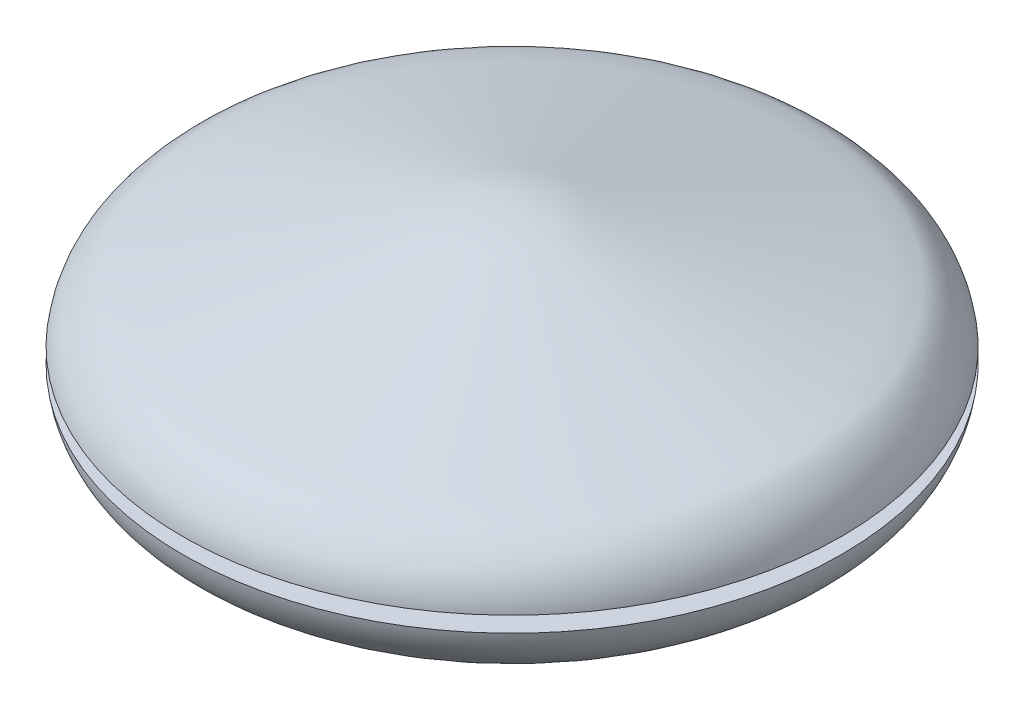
ISO-10303-21;
HEADER;
FILE_DESCRIPTION(('STEP AP214'),'2;1');
FILE_NAME('part.step','',(''),(''),'','','');
FILE_SCHEMA(('AUTOMOTIVE_DESIGN { 1 0 10303 214 1 1 1 1 }'));
ENDSEC;
DATA;
#1=APPLICATION_CONTEXT('core data for automotive mechanical design processes');
#2=APPLICATION_PROTOCOL_DEFINITION('international standard','automotive_design',2000,#1);
#3=PRODUCT_CONTEXT('',#1,'mechanical');
#4=PRODUCT('Part','Part','',(#3));
#5=PRODUCT_RELATED_PRODUCT_CATEGORY('part','',(#4));
#6=PRODUCT_DEFINITION_FORMATION('','',#4);
#7=PRODUCT_DEFINITION_CONTEXT('part definition',#1,'design');
#8=PRODUCT_DEFINITION('design','',#6,#7);
#9=PRODUCT_DEFINITION_SHAPE('','',#8);
#10=(LENGTH_UNIT() NAMED_UNIT(*) SI_UNIT(.MILLI.,.METRE.));
#11=(NAMED_UNIT(*) PLANE_ANGLE_UNIT() SI_UNIT($,.RADIAN.));
#12=(NAMED_UNIT(*) SI_UNIT($,.STERADIAN.) SOLID_ANGLE_UNIT());
#13=UNCERTAINTY_MEASURE_WITH_UNIT(LENGTH_MEASURE(1.E-05),#10,'distance_accuracy_value','');
#14=(GEOMETRIC_REPRESENTATION_CONTEXT(3) GLOBAL_UNCERTAINTY_ASSIGNED_CONTEXT((#13)) GLOBAL_UNIT_ASSIGNED_CONTEXT((#10,
#11,#12)) REPRESENTATION_CONTEXT('',''));
#15=CARTESIAN_POINT('',(0.,0.,0.));
#16=DIRECTION('',(0.,0.,1.));
#17=DIRECTION('',(1.,0.,0.));
#18=AXIS2_PLACEMENT_3D('',#15,#16,#17);
#19=CARTESIAN_POINT('',(0.,-19.5,0.));
#20=CARTESIAN_POINT('',(1.58855300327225,-19.5,0.));
#21=CARTESIAN_POINT('',(3.17483133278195,-19.4150193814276,0.));
#22=CARTESIAN_POINT('',(4.75429215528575,-19.2453015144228,0.));
#23=CARTESIAN_POINT('',(4.9296947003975,-19.2264539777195,0.));
#24=CARTESIAN_POINT('',(5.2802756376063,-19.1866728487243,0.));
#25=CARTESIAN_POINT('',(5.80578212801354,-19.1228170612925,0.));
#26=CARTESIAN_POINT('',(6.15501922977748,-19.072631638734,0.));
#27=CARTESIAN_POINT('',(6.32963778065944,-19.0475389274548,0.));
#28=CARTESIAN_POINT('',(6.5042563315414,-19.0224462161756,0.));
#29=CARTESIAN_POINT('',(6.85349343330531,-18.9722607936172,0.));
#30=CARTESIAN_POINT('',(7.37734908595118,-18.8969826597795,0.));
#31=CARTESIAN_POINT('',(7.72658618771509,-18.8467972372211,0.));
#32=CARTESIAN_POINT('',(7.90120473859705,-18.8217045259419,0.));
#33=CARTESIAN_POINT('',(18.989436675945,-17.2283239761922,0.));
#34=CARTESIAN_POINT('',(30.0776686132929,-15.6349434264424,0.));
#35=CARTESIAN_POINT('',(41.1659005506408,-14.0415628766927,0.));
#36=CARTESIAN_POINT('',(42.4561325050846,-13.8561563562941,0.));
#37=CARTESIAN_POINT('',(45.0365964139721,-13.4853433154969,0.));
#38=CARTESIAN_POINT('',(48.9072922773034,-12.9291237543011,0.));
#39=CARTESIAN_POINT('',(51.4877561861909,-12.5583107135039,0.));
#40=CARTESIAN_POINT('',(52.7779881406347,-12.3729041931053,0.));
#41=CARTESIAN_POINT('',(53.7007098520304,-12.240308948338,0.));
#42=CARTESIAN_POINT('',(55.5461532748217,-11.9751184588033,0.));
#43=CARTESIAN_POINT('',(58.1537486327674,-10.3790350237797,0.));
#44=CARTESIAN_POINT('',(59.5693539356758,-9.14795988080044,0.));
#45=CARTESIAN_POINT('',(60.2004034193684,-8.46183058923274,0.));
#46=CARTESIAN_POINT('',(64.3973475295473,-3.89856516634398,0.));
#47=CARTESIAN_POINT('',(64.7637835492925,2.29041341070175,0.));
#48=CARTESIAN_POINT('',(61.134636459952,7.31704474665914,0.));
#49=CARTESIAN_POINT('',(60.5889605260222,8.0728454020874,0.));
#50=CARTESIAN_POINT('',(59.3285148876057,9.46236372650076,0.));
#51=CARTESIAN_POINT('',(56.9274789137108,11.3549973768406,0.));
#52=CARTESIAN_POINT('',(55.1262219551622,11.836101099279,0.));
#53=CARTESIAN_POINT('',(54.225593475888,12.0766529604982,0.));
#54=CARTESIAN_POINT('',(53.0383023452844,12.3937705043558,0.));
#55=CARTESIAN_POINT('',(50.6637200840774,13.0280055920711,0.));
#56=CARTESIAN_POINT('',(47.1018466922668,13.9793582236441,0.));
#57=CARTESIAN_POINT('',(44.7272644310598,14.6135933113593,0.));
#58=CARTESIAN_POINT('',(43.5399733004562,14.930710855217,0.));
#59=CARTESIAN_POINT('',(33.7892849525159,17.5350546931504,0.));
#60=CARTESIAN_POINT('',(24.0385966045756,20.1393985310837,0.));
#61=CARTESIAN_POINT('',(14.2879082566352,22.7437423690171,0.));
#62=CARTESIAN_POINT('',(13.9762643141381,22.8269803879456,0.));
#63=CARTESIAN_POINT('',(13.3529764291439,22.9934564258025,0.));
#64=CARTESIAN_POINT('',(12.4180446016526,23.243170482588,0.));
#65=CARTESIAN_POINT('',(11.7947567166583,23.409646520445,0.));
#66=CARTESIAN_POINT('',(11.4831127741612,23.4928845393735,0.));
#67=CARTESIAN_POINT('',(11.1714688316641,23.5761225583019,0.));
#68=CARTESIAN_POINT('',(10.5481809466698,23.7425985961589,0.));
#69=CARTESIAN_POINT('',(9.60323358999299,23.9550354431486,0.));
#70=CARTESIAN_POINT('',(8.97178156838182,24.0873971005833,0.));
#71=CARTESIAN_POINT('',(8.65537337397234,24.1501375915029,0.));
#72=CARTESIAN_POINT('',(5.80263754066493,24.7158057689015,0.));
#73=CARTESIAN_POINT('',(2.90827822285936,25.,0.));
#74=CARTESIAN_POINT('',(0.,25.,0.));
#75=(BOUNDED_CURVE() B_SPLINE_CURVE(3,(#19,#20,#21,#22,#23,#24,#25,#26,#27,#28,#29,#30,#31,#32,
#33,#34,#35,#36,#37,#38,#39,#40,#41,#42,#43,#44,#45,#46,#47,#48,#49,#50,#51,#52,#53,#54,#55,#56,
#57,#58,#59,#60,#61,#62,#63,#64,#65,#66,#67,#68,#69,#70,#71,#72,#73,#74),.UNSPECIFIED.,.F.,
.F.) B_SPLINE_CURVE_WITH_KNOTS((4,3,1,1,3,1,1,3,3,1,1,3,1,1,3,3,1,1,3,1,1,3,3,1,1,3,1,1,3,4),
(0.,0.0335996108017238,0.0373344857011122,0.0410693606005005,0.0448042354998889,
0.0485391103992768,0.0522739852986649,0.056008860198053,0.293172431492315,0.320768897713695,
0.348365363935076,0.375961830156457,0.395697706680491,0.415433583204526,0.43516945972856,
0.546717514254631,0.566453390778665,0.5861892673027,0.605925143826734,0.631942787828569,
0.657960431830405,0.68397807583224,0.897649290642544,0.904478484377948,0.911307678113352,
0.918136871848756,0.92496606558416,0.931795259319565,0.938624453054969,1.),
.UNSPECIFIED.) CURVE() GEOMETRIC_REPRESENTATION_ITEM() RATIONAL_B_SPLINE_CURVE((1.,
0.999045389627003,0.999045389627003,1.,1.,1.,1.,1.,1.,1.,1.,1.,1.,1.,1.,1.,1.,1.,1.,1.,1.,1.,1.,
1.,1.,1.,1.,0.849837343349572,0.849837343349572,1.,1.,1.,1.,1.,1.,1.,1.,1.,1.,1.,1.,1.,1.,1.,1.,
1.,1.,1.,1.,1.,1.,1.,1.,0.996809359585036,0.996809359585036,1.)) REPRESENTATION_ITEM(''));
#76=CARTESIAN_POINT('',(0.,-19.5,0.));
#77=DIRECTION('',(0.,-1.,0.));
#78=AXIS1_PLACEMENT('',#76,#77);
#79=SURFACE_OF_REVOLUTION('',#75,#78);
#80=CARTESIAN_POINT('',(0.,-19.5,0.));
#81=VERTEX_POINT('',#80);
#82=VERTEX_LOOP('',#81);
#83=FACE_BOUND('',#82,.T.);
#84=CARTESIAN_POINT('',(0.,-1.50000000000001,0.));
#85=DIRECTION('',(0.,-1.,0.));
#86=DIRECTION('',(1.,0.,0.));
#87=AXIS2_PLACEMENT_3D('',#84,#85,#86);
#88=CIRCLE('',#87,63.4096736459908);
#89=CARTESIAN_POINT('',(63.4096736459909,-1.49999999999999,0.));
#90=VERTEX_POINT('',#89);
#91=EDGE_CURVE('E12',#90,#90,#88,.T.);
#92=ORIENTED_EDGE('',*,*,#91,.T.);
#93=EDGE_LOOP('',(#92));
#94=FACE_BOUND('',#93,.T.);
#95=ADVANCED_FACE('F38',(#83,#94),#79,.F.);
#96=CARTESIAN_POINT('',(0.,-1.5,0.));
#97=DIRECTION('',(0.,1.,0.));
#98=DIRECTION('',(0.,0.,1.));
#99=AXIS2_PLACEMENT_3D('',#96,#97,#98);
#100=PLANE('',#99);
#101=ORIENTED_EDGE('',*,*,#91,.F.);
#102=EDGE_LOOP('',(#101));
#103=FACE_BOUND('',#102,.T.);
#104=CARTESIAN_POINT('',(0.,-1.5,0.));
#105=DIRECTION('',(0.,1.,0.));
#106=DIRECTION('',(1.,0.,0.));
#107=AXIS2_PLACEMENT_3D('',#104,#105,#106);
#108=CIRCLE('',#107,57.1499999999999);
#109=CARTESIAN_POINT('',(57.15,-1.5,0.));
#110=VERTEX_POINT('',#109);
#111=EDGE_CURVE('E75',#110,#110,#108,.T.);
#112=ORIENTED_EDGE('',*,*,#111,.F.);
#113=EDGE_LOOP('',(#112));
#114=FACE_BOUND('',#113,.T.);
#115=ADVANCED_FACE('F64',(#103,#114),#100,.T.);
#116=CARTESIAN_POINT('',(0.,1.5,0.));
#117=DIRECTION('',(0.,1.,0.));
#118=DIRECTION('',(0.,0.,1.));
#119=AXIS2_PLACEMENT_3D('',#116,#117,#118);
#120=PLANE('',#119);
#121=CARTESIAN_POINT('',(0.,1.49999999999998,0.));
#122=DIRECTION('',(0.,-1.,0.));
#123=DIRECTION('',(1.,0.,0.));
#124=AXIS2_PLACEMENT_3D('',#121,#122,#123);
#125=CIRCLE('',#124,63.4096736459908);
#126=CARTESIAN_POINT('',(63.4096736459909,1.5,0.));
#127=VERTEX_POINT('',#126);
#128=EDGE_CURVE('E47',#127,#127,#125,.T.);
#129=ORIENTED_EDGE('',*,*,#128,.T.);
#130=EDGE_LOOP('',(#129));
#131=FACE_BOUND('',#130,.T.);
#132=CARTESIAN_POINT('',(0.,1.5,0.));
#133=DIRECTION('',(0.,1.,0.));
#134=DIRECTION('',(1.,0.,0.));
#135=AXIS2_PLACEMENT_3D('',#132,#133,#134);
#136=CIRCLE('',#135,57.1499999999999);
#137=CARTESIAN_POINT('',(57.15,1.5,0.));
#138=VERTEX_POINT('',#137);
#139=EDGE_CURVE('E76',#138,#138,#136,.T.);
#140=ORIENTED_EDGE('',*,*,#139,.T.);
#141=EDGE_LOOP('',(#140));
#142=FACE_BOUND('',#141,.T.);
#143=ADVANCED_FACE('F59',(#131,#142),#120,.F.);
#144=CARTESIAN_POINT('',(0.,-1.5,0.));
#145=DIRECTION('',(0.,1.,0.));
#146=DIRECTION('',(0.,0.,1.));
#147=AXIS2_PLACEMENT_3D('',#144,#145,#146);
#148=CYLINDRICAL_SURFACE('',#147,57.1499999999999);
#149=ORIENTED_EDGE('',*,*,#111,.T.);
#150=EDGE_LOOP('',(#149));
#151=FACE_BOUND('',#150,.T.);
#152=ORIENTED_EDGE('',*,*,#139,.F.);
#153=EDGE_LOOP('',(#152));
#154=FACE_BOUND('',#153,.T.);
#155=ADVANCED_FACE('F54',(#151,#154),#148,.T.);
#156=ORIENTED_EDGE('',*,*,#128,.F.);
#157=EDGE_LOOP('',(#156));
#158=FACE_BOUND('',#157,.T.);
#159=CARTESIAN_POINT('',(0.,25.,0.));
#160=VERTEX_POINT('',#159);
#161=VERTEX_LOOP('',#160);
#162=FACE_BOUND('',#161,.T.);
#163=ADVANCED_FACE('F40',(#158,#162),#79,.F.);
#164=CLOSED_SHELL('',(#95,#115,#143,#155,#163));
#165=MANIFOLD_SOLID_BREP('B2',#164);
#166=ADVANCED_BREP_SHAPE_REPRESENTATION('',(#18,#165),#14);
#167=SHAPE_DEFINITION_REPRESENTATION(#9,#166);
ENDSEC;
END-ISO-10303-21;
